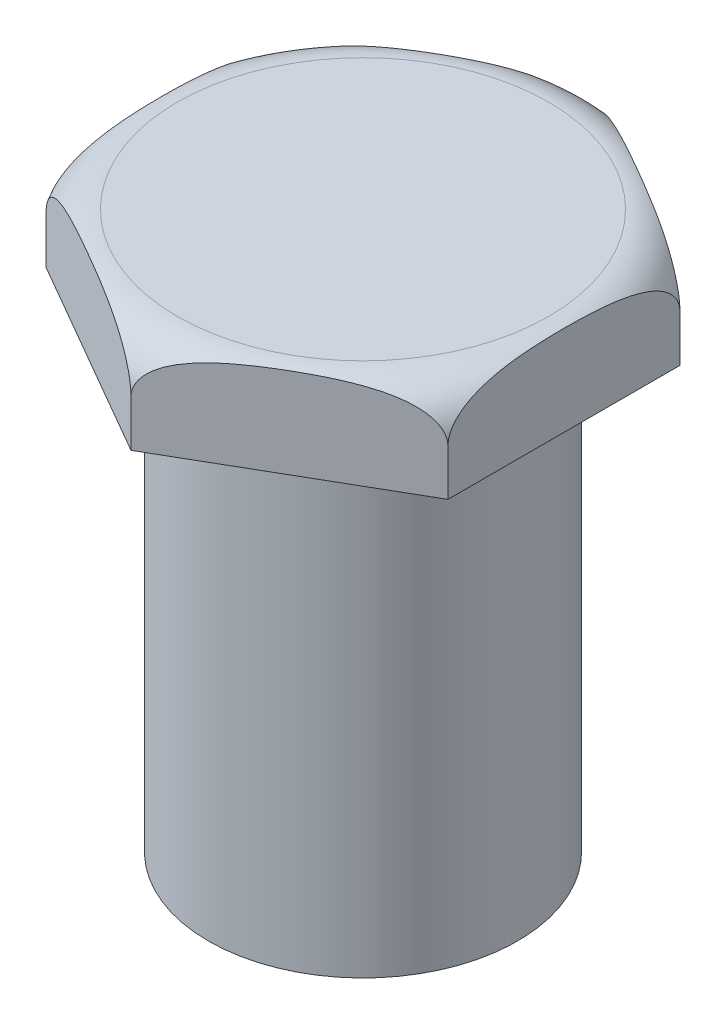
from build123d import *

# Parameters (mm, degrees)
SKETCH1_R      = 5
EXTRUDE1_DEPTH = 15
EXTRUDE2_DEPTH = 3


with BuildPart() as part:
    # Sketch1 → Extrude1 (new body)
    with BuildSketch(Plane(origin=(0, 0, 0), x_dir=(1, 0, 0), z_dir=(0, 1, 0))):
        with Locations(Location((0, 0, 0), (0, 0, 270))):
            Circle(SKETCH1_R)
    extrude(amount=EXTRUDE1_DEPTH)

    # Sketch2 → Extrude2 (add)
    with BuildSketch(Plane(origin=(0, 15, 0), x_dir=(-1, 0, 0), z_dir=(0, 1, 0))):
        Polygon((0, 7.505553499), (-6.5, 3.75277675), (-6.5, -3.75277675), (0, -7.505553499), (6.5, -3.75277675), (6.5, 3.75277675), align=None)
    extrude(amount=EXTRUDE2_DEPTH)

    # Sketch3 → Cut-Revolve1 (revolve, cut)
    with BuildSketch(Plane(origin=(0, 0, 0), x_dir=(0, 0, -1), z_dir=(1, 0, 0))):
        with BuildLine():
            Line((6.005553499, 18), (6.005553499, 18.947819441))
            Line((6.005553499, 18.947819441), (9.513647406, 19.138859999))
            Line((9.513647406, 19.138859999), (9.19161943, 16.308186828))
            Line((9.19161943, 16.308186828), (7.505553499, 16.5))
            ThreePointArc((7.505553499, 16.5), (7.066213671, 17.560660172), (6.005553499, 18))
        make_face()
    revolve(axis=Axis((0, 0, 0), (0, 1, 0)), mode=Mode.SUBTRACT)


solid = part.part
